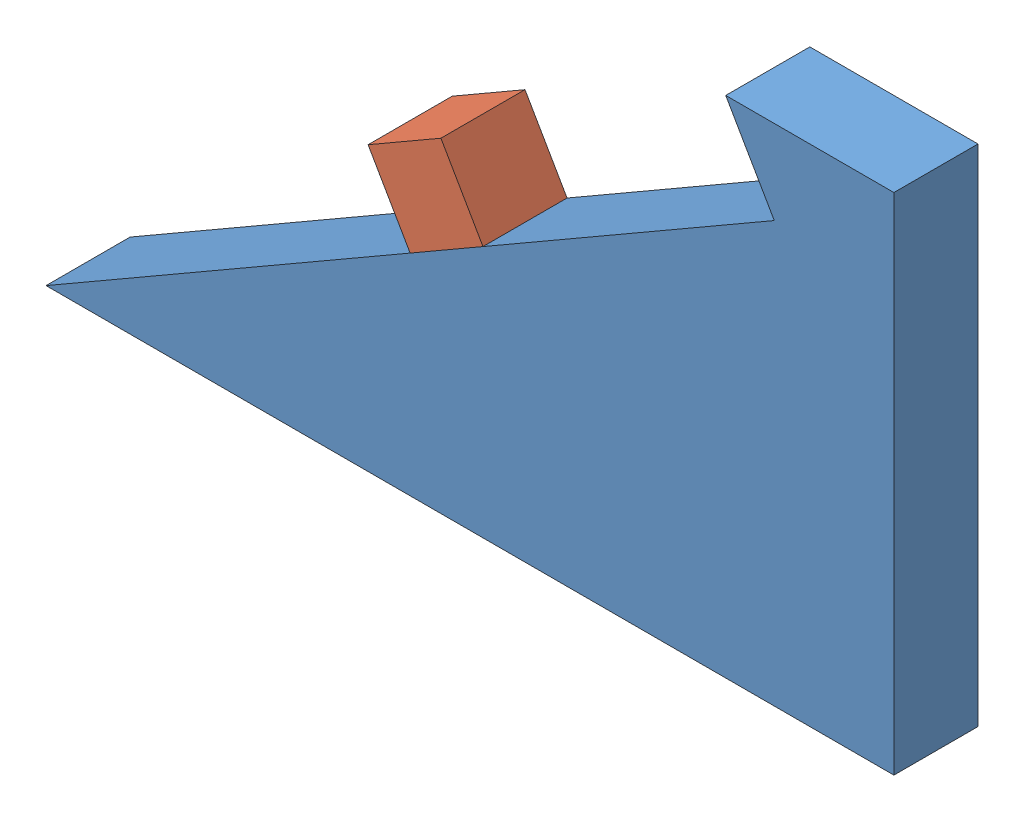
SolidWorks assembly Lesson5withresults.SLDASM, configuration Default (file format 4100). Lengths in mm.
Overall size (256.11 152.4 25.4).
2 component instances, 2 part files, 5 mates.
Components (placement in the parent):
- ground-1: ground.SLDPRT [Default] at origin size (256.11 152.4 25.4)
- block-1: block.SLDPRT [Default] at (-105.3367 -46.1515 0) x (0.866025 0.5 0) z (0 0 1) size (25.4 25.4 25.4)
Mates (geometry in assembly coordinates):
- LinearSpring3: unknown: plane of ground-1 through (0 0 -12.7) normal (-0.866025 -0.5 0); plane of block-1 through (-100.6882 -28.803 12.7) normal (0.866025 0.5 0); plane of ground-1 through (0 0 -12.7) normal (-0.866025 -0.5 0); plane of ? through (-59.192 -4.8451 12.7) normal (0.866025 0.5 0); plane of ? through (-96.3613 -55.6342 12.7) normal (-0.866025 -0.5 0)
- Coincident1: coincident: plane of ground-1 through (0 0 -12.7) normal (-0.5 0.866025 0); plane of block-1 through (-87.9882 -50.8 12.7) normal (0.5 -0.866025 0)
- Coincident3: coincident: plane of ground-1 through (0 0 12.7) normal (0 0 1); plane of block-1 through (-122.6852 -41.503 12.7) normal (0 0 1)
- LimitDistance1: limit distance = 101.6 mm: plane of ground-1 through (0 0 -12.7) normal (-0.866025 -0.5 0); plane of block-1 through (-100.6882 -28.803 12.7) normal (0.866025 0.5 0); plane of ground-1; plane of block-1; plane of ground-1; plane of block-1; plane of ground-1; plane of block-1
- Linear Displacement3: unknown: plane of ground-1 through (0 0 -12.7) normal (-0.866025 -0.5 0); plane of block-1 through (-100.6882 -28.803 12.7) normal (0.866025 0.5 0); unknown of block-1; plane of ground-1 through (0 0 -12.7) normal (-0.866025 -0.5 0); plane of block-1 through (-100.6882 -28.803 12.7) normal (0.866025 0.5 0); unknown of block-1
